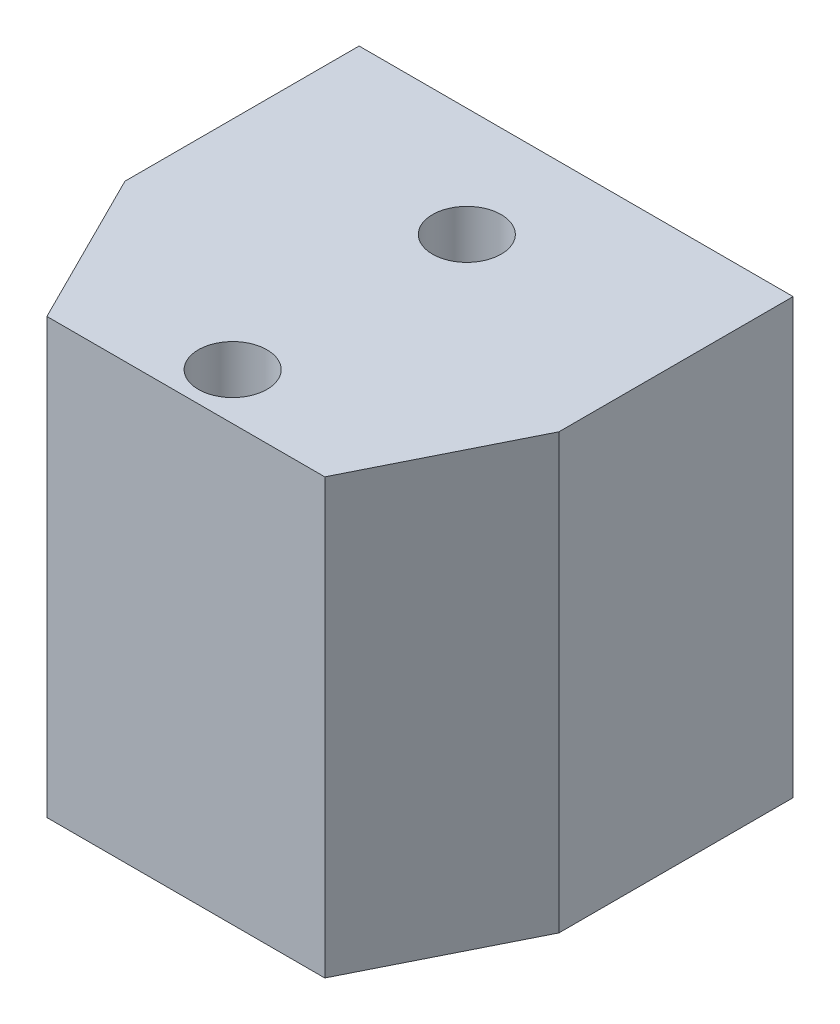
ISO-10303-21;
HEADER;
FILE_DESCRIPTION(('STEP AP214'),'2;1');
FILE_NAME('part.step','',(''),(''),'','','');
FILE_SCHEMA(('AUTOMOTIVE_DESIGN { 1 0 10303 214 1 1 1 1 }'));
ENDSEC;
DATA;
#1=APPLICATION_CONTEXT('core data for automotive mechanical design processes');
#2=APPLICATION_PROTOCOL_DEFINITION('international standard','automotive_design',2000,#1);
#3=PRODUCT_CONTEXT('',#1,'mechanical');
#4=PRODUCT('Part','Part','',(#3));
#5=PRODUCT_RELATED_PRODUCT_CATEGORY('part','',(#4));
#6=PRODUCT_DEFINITION_FORMATION('','',#4);
#7=PRODUCT_DEFINITION_CONTEXT('part definition',#1,'design');
#8=PRODUCT_DEFINITION('design','',#6,#7);
#9=PRODUCT_DEFINITION_SHAPE('','',#8);
#10=(LENGTH_UNIT() NAMED_UNIT(*) SI_UNIT(.MILLI.,.METRE.));
#11=(NAMED_UNIT(*) PLANE_ANGLE_UNIT() SI_UNIT($,.RADIAN.));
#12=(NAMED_UNIT(*) SI_UNIT($,.STERADIAN.) SOLID_ANGLE_UNIT());
#13=UNCERTAINTY_MEASURE_WITH_UNIT(LENGTH_MEASURE(1.E-05),#10,'distance_accuracy_value','');
#14=(GEOMETRIC_REPRESENTATION_CONTEXT(3) GLOBAL_UNCERTAINTY_ASSIGNED_CONTEXT((#13)) GLOBAL_UNIT_ASSIGNED_CONTEXT((#10,
#11,#12)) REPRESENTATION_CONTEXT('',''));
#15=CARTESIAN_POINT('',(0.,0.,0.));
#16=DIRECTION('',(0.,0.,1.));
#17=DIRECTION('',(1.,0.,0.));
#18=AXIS2_PLACEMENT_3D('',#15,#16,#17);
#19=CARTESIAN_POINT('',(5.,-2.2,25.));
#20=DIRECTION('',(0.894427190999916,0.,-0.447213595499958));
#21=DIRECTION('',(0.,-1.,0.));
#22=AXIS2_PLACEMENT_3D('',#19,#20,#21);
#23=PLANE('',#22);
#24=DIRECTION('',(0.,-1.,0.));
#25=VECTOR('',#24,1.);
#26=CARTESIAN_POINT('',(5.,0.,25.));
#27=LINE('',#26,#25);
#28=CARTESIAN_POINT('',(5.,27.8,25.));
#29=VERTEX_POINT('',#28);
#30=CARTESIAN_POINT('',(5.,0.,25.));
#31=VERTEX_POINT('',#30);
#32=EDGE_CURVE('E26',#29,#31,#27,.T.);
#33=ORIENTED_EDGE('',*,*,#32,.F.);
#34=DIRECTION('',(-0.447213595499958,0.,-0.894427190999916));
#35=VECTOR('',#34,1.);
#36=CARTESIAN_POINT('',(5.,27.8,25.));
#37=LINE('',#36,#35);
#38=CARTESIAN_POINT('',(0.,27.8,15.));
#39=VERTEX_POINT('',#38);
#40=EDGE_CURVE('E104',#29,#39,#37,.T.);
#41=ORIENTED_EDGE('',*,*,#40,.T.);
#42=DIRECTION('',(0.,1.,0.));
#43=VECTOR('',#42,1.);
#44=CARTESIAN_POINT('',(0.,-2.2,15.));
#45=LINE('',#44,#43);
#46=CARTESIAN_POINT('',(0.,0.,15.));
#47=VERTEX_POINT('',#46);
#48=EDGE_CURVE('E139',#47,#39,#45,.T.);
#49=ORIENTED_EDGE('',*,*,#48,.F.);
#50=DIRECTION('',(-0.447213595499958,0.,-0.894427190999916));
#51=VECTOR('',#50,1.);
#52=CARTESIAN_POINT('',(4.,0.,23.));
#53=LINE('',#52,#51);
#54=EDGE_CURVE('E137',#31,#47,#53,.T.);
#55=ORIENTED_EDGE('',*,*,#54,.F.);
#56=EDGE_LOOP('',(#33,#41,#49,#55));
#57=FACE_BOUND('',#56,.T.);
#58=ADVANCED_FACE('F17',(#57),#23,.F.);
#59=CARTESIAN_POINT('',(22.8,-2.2,25.));
#60=DIRECTION('',(-0.894427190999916,0.,-0.447213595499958));
#61=DIRECTION('',(-0.447213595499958,0.,0.894427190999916));
#62=AXIS2_PLACEMENT_3D('',#59,#60,#61);
#63=PLANE('',#62);
#64=DIRECTION('',(0.,1.,0.));
#65=VECTOR('',#64,1.);
#66=CARTESIAN_POINT('',(27.8,-2.2,15.));
#67=LINE('',#66,#65);
#68=CARTESIAN_POINT('',(27.8,0.,15.));
#69=VERTEX_POINT('',#68);
#70=CARTESIAN_POINT('',(27.8,27.8,15.));
#71=VERTEX_POINT('',#70);
#72=EDGE_CURVE('E105',#69,#71,#67,.T.);
#73=ORIENTED_EDGE('',*,*,#72,.T.);
#74=DIRECTION('',(-0.447213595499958,0.,0.894427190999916));
#75=VECTOR('',#74,1.);
#76=CARTESIAN_POINT('',(22.8,27.8,25.));
#77=LINE('',#76,#75);
#78=CARTESIAN_POINT('',(22.8,27.8,25.));
#79=VERTEX_POINT('',#78);
#80=EDGE_CURVE('E94',#71,#79,#77,.T.);
#81=ORIENTED_EDGE('',*,*,#80,.T.);
#82=DIRECTION('',(0.,1.,0.));
#83=VECTOR('',#82,1.);
#84=CARTESIAN_POINT('',(22.8,0.,25.));
#85=LINE('',#84,#83);
#86=CARTESIAN_POINT('',(22.8,0.,25.));
#87=VERTEX_POINT('',#86);
#88=EDGE_CURVE('E11',#87,#79,#85,.T.);
#89=ORIENTED_EDGE('',*,*,#88,.F.);
#90=DIRECTION('',(-0.447213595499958,0.,0.894427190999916));
#91=VECTOR('',#90,1.);
#92=CARTESIAN_POINT('',(18.24,0.,34.12));
#93=LINE('',#92,#91);
#94=EDGE_CURVE('E111',#69,#87,#93,.T.);
#95=ORIENTED_EDGE('',*,*,#94,.F.);
#96=EDGE_LOOP('',(#73,#81,#89,#95));
#97=FACE_BOUND('',#96,.T.);
#98=ADVANCED_FACE('F289',(#97),#63,.F.);
#99=CARTESIAN_POINT('',(0.,0.,0.));
#100=DIRECTION('',(0.,0.,-1.));
#101=DIRECTION('',(0.,-1.,0.));
#102=AXIS2_PLACEMENT_3D('',#99,#100,#101);
#103=PLANE('',#102);
#104=DIRECTION('',(0.,-1.,0.));
#105=VECTOR('',#104,1.);
#106=CARTESIAN_POINT('',(0.,0.,0.));
#107=LINE('',#106,#105);
#108=CARTESIAN_POINT('',(0.,27.8,0.));
#109=VERTEX_POINT('',#108);
#110=CARTESIAN_POINT('',(0.,0.,0.));
#111=VERTEX_POINT('',#110);
#112=EDGE_CURVE('E88',#109,#111,#107,.T.);
#113=ORIENTED_EDGE('',*,*,#112,.F.);
#114=DIRECTION('',(-1.,0.,0.));
#115=VECTOR('',#114,1.);
#116=CARTESIAN_POINT('',(0.,27.8,0.));
#117=LINE('',#116,#115);
#118=CARTESIAN_POINT('',(27.8,27.8,0.));
#119=VERTEX_POINT('',#118);
#120=EDGE_CURVE('E82',#119,#109,#117,.T.);
#121=ORIENTED_EDGE('',*,*,#120,.F.);
#122=DIRECTION('',(0.,1.,0.));
#123=VECTOR('',#122,1.);
#124=CARTESIAN_POINT('',(27.8,0.,0.));
#125=LINE('',#124,#123);
#126=CARTESIAN_POINT('',(27.8,0.,0.));
#127=VERTEX_POINT('',#126);
#128=EDGE_CURVE('E85',#127,#119,#125,.T.);
#129=ORIENTED_EDGE('',*,*,#128,.F.);
#130=DIRECTION('',(1.,0.,0.));
#131=VECTOR('',#130,1.);
#132=CARTESIAN_POINT('',(0.,0.,0.));
#133=LINE('',#132,#131);
#134=EDGE_CURVE('E144',#111,#127,#133,.T.);
#135=ORIENTED_EDGE('',*,*,#134,.F.);
#136=EDGE_LOOP('',(#113,#121,#129,#135));
#137=FACE_BOUND('',#136,.T.);
#138=ADVANCED_FACE('F84',(#137),#103,.T.);
#139=CARTESIAN_POINT('',(0.,0.,25.));
#140=DIRECTION('',(0.,0.,-1.));
#141=DIRECTION('',(0.,-1.,0.));
#142=AXIS2_PLACEMENT_3D('',#139,#140,#141);
#143=PLANE('',#142);
#144=DIRECTION('',(-1.,0.,0.));
#145=VECTOR('',#144,1.);
#146=CARTESIAN_POINT('',(0.,27.8,25.));
#147=LINE('',#146,#145);
#148=EDGE_CURVE('E125',#79,#29,#147,.T.);
#149=ORIENTED_EDGE('',*,*,#148,.T.);
#150=ORIENTED_EDGE('',*,*,#32,.T.);
#151=DIRECTION('',(1.,0.,0.));
#152=VECTOR('',#151,1.);
#153=CARTESIAN_POINT('',(0.,0.,25.));
#154=LINE('',#153,#152);
#155=EDGE_CURVE('E133',#31,#87,#154,.T.);
#156=ORIENTED_EDGE('',*,*,#155,.T.);
#157=ORIENTED_EDGE('',*,*,#88,.T.);
#158=EDGE_LOOP('',(#149,#150,#156,#157));
#159=FACE_BOUND('',#158,.T.);
#160=ADVANCED_FACE('F131',(#159),#143,.F.);
#161=CARTESIAN_POINT('',(0.,27.8,25.));
#162=DIRECTION('',(0.,-1.,0.));
#163=DIRECTION('',(0.,0.,-1.));
#164=AXIS2_PLACEMENT_3D('',#161,#162,#163);
#165=PLANE('',#164);
#166=CARTESIAN_POINT('',(13.9,27.8,22.));
#167=DIRECTION('',(0.,1.,0.));
#168=DIRECTION('',(0.,0.,1.));
#169=AXIS2_PLACEMENT_3D('',#166,#167,#168);
#170=CIRCLE('',#169,2.2);
#171=CARTESIAN_POINT('',(13.9,27.8,24.2));
#172=VERTEX_POINT('',#171);
#173=EDGE_CURVE('E182',#172,#172,#170,.T.);
#174=ORIENTED_EDGE('',*,*,#173,.F.);
#175=EDGE_LOOP('',(#174));
#176=FACE_BOUND('',#175,.T.);
#177=CARTESIAN_POINT('',(13.9,27.8,7.));
#178=DIRECTION('',(0.,1.,0.));
#179=DIRECTION('',(0.,0.,1.));
#180=AXIS2_PLACEMENT_3D('',#177,#178,#179);
#181=CIRCLE('',#180,2.2);
#182=CARTESIAN_POINT('',(13.9,27.8,9.2));
#183=VERTEX_POINT('',#182);
#184=EDGE_CURVE('E390',#183,#183,#181,.T.);
#185=ORIENTED_EDGE('',*,*,#184,.F.);
#186=EDGE_LOOP('',(#185));
#187=FACE_BOUND('',#186,.T.);
#188=DIRECTION('',(0.,0.,-1.));
#189=VECTOR('',#188,1.);
#190=CARTESIAN_POINT('',(0.,27.8,25.));
#191=LINE('',#190,#189);
#192=EDGE_CURVE('E153',#39,#109,#191,.T.);
#193=ORIENTED_EDGE('',*,*,#192,.F.);
#194=ORIENTED_EDGE('',*,*,#40,.F.);
#195=ORIENTED_EDGE('',*,*,#148,.F.);
#196=ORIENTED_EDGE('',*,*,#80,.F.);
#197=DIRECTION('',(0.,0.,-1.));
#198=VECTOR('',#197,1.);
#199=CARTESIAN_POINT('',(27.8,27.8,25.));
#200=LINE('',#199,#198);
#201=EDGE_CURVE('E99',#71,#119,#200,.T.);
#202=ORIENTED_EDGE('',*,*,#201,.T.);
#203=ORIENTED_EDGE('',*,*,#120,.T.);
#204=EDGE_LOOP('',(#193,#194,#195,#196,#202,#203));
#205=FACE_BOUND('',#204,.T.);
#206=ADVANCED_FACE('F107',(#176,#187,#205),#165,.F.);
#207=CARTESIAN_POINT('',(27.8,0.,25.));
#208=DIRECTION('',(-1.,0.,0.));
#209=DIRECTION('',(0.,0.,1.));
#210=AXIS2_PLACEMENT_3D('',#207,#208,#209);
#211=PLANE('',#210);
#212=ORIENTED_EDGE('',*,*,#201,.F.);
#213=ORIENTED_EDGE('',*,*,#72,.F.);
#214=DIRECTION('',(0.,0.,-1.));
#215=VECTOR('',#214,1.);
#216=CARTESIAN_POINT('',(27.8,0.,25.));
#217=LINE('',#216,#215);
#218=EDGE_CURVE('E101',#69,#127,#217,.T.);
#219=ORIENTED_EDGE('',*,*,#218,.T.);
#220=ORIENTED_EDGE('',*,*,#128,.T.);
#221=EDGE_LOOP('',(#212,#213,#219,#220));
#222=FACE_BOUND('',#221,.T.);
#223=ADVANCED_FACE('F98',(#222),#211,.F.);
#224=CARTESIAN_POINT('',(0.,0.,25.));
#225=DIRECTION('',(0.,1.,0.));
#226=DIRECTION('',(1.,0.,0.));
#227=AXIS2_PLACEMENT_3D('',#224,#225,#226);
#228=PLANE('',#227);
#229=CARTESIAN_POINT('',(13.9,0.,22.));
#230=DIRECTION('',(0.,1.,0.));
#231=DIRECTION('',(0.,0.,1.));
#232=AXIS2_PLACEMENT_3D('',#229,#230,#231);
#233=CIRCLE('',#232,2.2);
#234=CARTESIAN_POINT('',(13.9,0.,24.2));
#235=VERTEX_POINT('',#234);
#236=EDGE_CURVE('E383',#235,#235,#233,.T.);
#237=ORIENTED_EDGE('',*,*,#236,.T.);
#238=EDGE_LOOP('',(#237));
#239=FACE_BOUND('',#238,.T.);
#240=CARTESIAN_POINT('',(13.9,0.,7.));
#241=DIRECTION('',(0.,1.,0.));
#242=DIRECTION('',(0.,0.,1.));
#243=AXIS2_PLACEMENT_3D('',#240,#241,#242);
#244=CIRCLE('',#243,2.2);
#245=CARTESIAN_POINT('',(13.9,0.,9.2));
#246=VERTEX_POINT('',#245);
#247=EDGE_CURVE('E398',#246,#246,#244,.T.);
#248=ORIENTED_EDGE('',*,*,#247,.T.);
#249=EDGE_LOOP('',(#248));
#250=FACE_BOUND('',#249,.T.);
#251=ORIENTED_EDGE('',*,*,#155,.F.);
#252=ORIENTED_EDGE('',*,*,#54,.T.);
#253=DIRECTION('',(0.,0.,-1.));
#254=VECTOR('',#253,1.);
#255=CARTESIAN_POINT('',(0.,0.,25.));
#256=LINE('',#255,#254);
#257=EDGE_CURVE('E189',#47,#111,#256,.T.);
#258=ORIENTED_EDGE('',*,*,#257,.T.);
#259=ORIENTED_EDGE('',*,*,#134,.T.);
#260=ORIENTED_EDGE('',*,*,#218,.F.);
#261=ORIENTED_EDGE('',*,*,#94,.T.);
#262=EDGE_LOOP('',(#251,#252,#258,#259,#260,#261));
#263=FACE_BOUND('',#262,.T.);
#264=ADVANCED_FACE('F146',(#239,#250,#263),#228,.F.);
#265=CARTESIAN_POINT('',(0.,0.,25.));
#266=DIRECTION('',(1.,0.,0.));
#267=DIRECTION('',(0.,1.,0.));
#268=AXIS2_PLACEMENT_3D('',#265,#266,#267);
#269=PLANE('',#268);
#270=ORIENTED_EDGE('',*,*,#257,.F.);
#271=ORIENTED_EDGE('',*,*,#48,.T.);
#272=ORIENTED_EDGE('',*,*,#192,.T.);
#273=ORIENTED_EDGE('',*,*,#112,.T.);
#274=EDGE_LOOP('',(#270,#271,#272,#273));
#275=FACE_BOUND('',#274,.T.);
#276=ADVANCED_FACE('F267',(#275),#269,.F.);
#277=CARTESIAN_POINT('',(13.9,-2.2,22.));
#278=DIRECTION('',(0.,1.,0.));
#279=DIRECTION('',(0.,0.,1.));
#280=AXIS2_PLACEMENT_3D('',#277,#278,#279);
#281=CYLINDRICAL_SURFACE('',#280,2.2);
#282=ORIENTED_EDGE('',*,*,#173,.T.);
#283=EDGE_LOOP('',(#282));
#284=FACE_BOUND('',#283,.T.);
#285=ORIENTED_EDGE('',*,*,#236,.F.);
#286=EDGE_LOOP('',(#285));
#287=FACE_BOUND('',#286,.T.);
#288=ADVANCED_FACE('F251',(#284,#287),#281,.F.);
#289=CARTESIAN_POINT('',(13.9,-2.2,7.));
#290=DIRECTION('',(0.,1.,0.));
#291=DIRECTION('',(0.,0.,1.));
#292=AXIS2_PLACEMENT_3D('',#289,#290,#291);
#293=CYLINDRICAL_SURFACE('',#292,2.2);
#294=ORIENTED_EDGE('',*,*,#184,.T.);
#295=EDGE_LOOP('',(#294));
#296=FACE_BOUND('',#295,.T.);
#297=ORIENTED_EDGE('',*,*,#247,.F.);
#298=EDGE_LOOP('',(#297));
#299=FACE_BOUND('',#298,.T.);
#300=ADVANCED_FACE('F247',(#296,#299),#293,.F.);
#301=CLOSED_SHELL('',(#58,#98,#138,#160,#206,#223,#264,#276,#288,#300));
#302=MANIFOLD_SOLID_BREP('B1',#301);
#303=ADVANCED_BREP_SHAPE_REPRESENTATION('',(#18,#302),#14);
#304=SHAPE_DEFINITION_REPRESENTATION(#9,#303);
ENDSEC;
END-ISO-10303-21;
